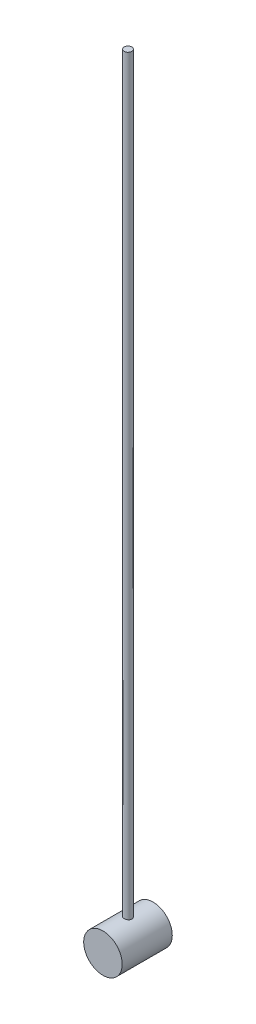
ISO-10303-21;
HEADER;
FILE_DESCRIPTION(('STEP AP214'),'2;1');
FILE_NAME('part.step','',(''),(''),'','','');
FILE_SCHEMA(('AUTOMOTIVE_DESIGN { 1 0 10303 214 1 1 1 1 }'));
ENDSEC;
DATA;
#1=APPLICATION_CONTEXT('core data for automotive mechanical design processes');
#2=APPLICATION_PROTOCOL_DEFINITION('international standard','automotive_design',2000,#1);
#3=PRODUCT_CONTEXT('',#1,'mechanical');
#4=PRODUCT('Part','Part','',(#3));
#5=PRODUCT_RELATED_PRODUCT_CATEGORY('part','',(#4));
#6=PRODUCT_DEFINITION_FORMATION('','',#4);
#7=PRODUCT_DEFINITION_CONTEXT('part definition',#1,'design');
#8=PRODUCT_DEFINITION('design','',#6,#7);
#9=PRODUCT_DEFINITION_SHAPE('','',#8);
#10=(LENGTH_UNIT() NAMED_UNIT(*) SI_UNIT(.MILLI.,.METRE.));
#11=(NAMED_UNIT(*) PLANE_ANGLE_UNIT() SI_UNIT($,.RADIAN.));
#12=(NAMED_UNIT(*) SI_UNIT($,.STERADIAN.) SOLID_ANGLE_UNIT());
#13=UNCERTAINTY_MEASURE_WITH_UNIT(LENGTH_MEASURE(1.E-05),#10,'distance_accuracy_value','');
#14=(GEOMETRIC_REPRESENTATION_CONTEXT(3) GLOBAL_UNCERTAINTY_ASSIGNED_CONTEXT((#13)) GLOBAL_UNIT_ASSIGNED_CONTEXT((#10,
#11,#12)) REPRESENTATION_CONTEXT('',''));
#15=CARTESIAN_POINT('',(0.,0.,0.));
#16=DIRECTION('',(0.,0.,1.));
#17=DIRECTION('',(1.,0.,0.));
#18=AXIS2_PLACEMENT_3D('',#15,#16,#17);
#19=CARTESIAN_POINT('',(0.,0.,3.25));
#20=DIRECTION('',(0.,0.,-1.));
#21=DIRECTION('',(-1.,0.,0.));
#22=AXIS2_PLACEMENT_3D('',#19,#20,#21);
#23=CYLINDRICAL_SURFACE('',#22,2.5);
#24=CARTESIAN_POINT('',(0.,0.,-3.25));
#25=DIRECTION('',(0.,0.,1.));
#26=DIRECTION('',(1.,0.,0.));
#27=AXIS2_PLACEMENT_3D('',#24,#25,#26);
#28=CIRCLE('',#27,2.5);
#29=CARTESIAN_POINT('',(2.5,0.,-3.25));
#30=VERTEX_POINT('',#29);
#31=EDGE_CURVE('E45',#30,#30,#28,.T.);
#32=ORIENTED_EDGE('',*,*,#31,.T.);
#33=EDGE_LOOP('',(#32));
#34=FACE_BOUND('',#33,.T.);
#35=CARTESIAN_POINT('',(0.,0.,3.25));
#36=DIRECTION('',(0.,0.,1.));
#37=DIRECTION('',(1.,0.,0.));
#38=AXIS2_PLACEMENT_3D('',#35,#36,#37);
#39=CIRCLE('',#38,2.5);
#40=CARTESIAN_POINT('',(2.5,0.,3.25));
#41=VERTEX_POINT('',#40);
#42=EDGE_CURVE('E41',#41,#41,#39,.T.);
#43=ORIENTED_EDGE('',*,*,#42,.F.);
#44=EDGE_LOOP('',(#43));
#45=FACE_BOUND('',#44,.T.);
#46=CARTESIAN_POINT('',(0.,2.49999999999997,-0.5));
#47=CARTESIAN_POINT('',(-0.027788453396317,2.49999948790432,-0.499998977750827));
#48=CARTESIAN_POINT('',(-0.055589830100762,2.49953192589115,-0.497675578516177));
#49=CARTESIAN_POINT('',(-0.110406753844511,2.49771182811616,-0.488450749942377));
#50=CARTESIAN_POINT('',(-0.137421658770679,2.49635858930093,-0.481545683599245));
#51=CARTESIAN_POINT('',(-0.189865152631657,2.49291824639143,-0.463379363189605));
#52=CARTESIAN_POINT('',(-0.215295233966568,2.49083184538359,-0.452122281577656));
#53=CARTESIAN_POINT('',(-0.263903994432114,2.48615199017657,-0.425583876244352));
#54=CARTESIAN_POINT('',(-0.287082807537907,2.48355856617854,-0.410302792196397));
#55=CARTESIAN_POINT('',(-0.330846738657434,2.47811082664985,-0.375930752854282));
#56=CARTESIAN_POINT('',(-0.351396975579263,2.47525372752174,-0.356795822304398));
#57=CARTESIAN_POINT('',(-0.389018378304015,2.46962090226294,-0.315353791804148));
#58=CARTESIAN_POINT('',(-0.406089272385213,2.46684518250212,-0.29304644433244));
#59=CARTESIAN_POINT('',(-0.436415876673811,2.46166220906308,-0.245641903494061));
#60=CARTESIAN_POINT('',(-0.449635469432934,2.45925853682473,-0.220521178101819));
#61=CARTESIAN_POINT('',(-0.471652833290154,2.45513134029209,-0.168359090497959));
#62=CARTESIAN_POINT('',(-0.480451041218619,2.45340774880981,-0.141317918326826));
#63=CARTESIAN_POINT('',(-0.493262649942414,2.45086402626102,-0.08645781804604));
#64=CARTESIAN_POINT('',(-0.497337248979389,2.45003235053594,-0.0586537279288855));
#65=CARTESIAN_POINT('',(-0.50077606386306,2.44933187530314,-0.00274508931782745));
#66=CARTESIAN_POINT('',(-0.50014076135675,2.4494629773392,0.025359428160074));
#67=CARTESIAN_POINT('',(-0.494227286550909,2.45066275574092,0.0806233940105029));
#68=CARTESIAN_POINT('',(-0.489019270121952,2.45171726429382,0.107790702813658));
#69=CARTESIAN_POINT('',(-0.474218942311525,2.45462273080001,0.160858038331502));
#70=CARTESIAN_POINT('',(-0.46462642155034,2.45647372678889,0.186758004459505));
#71=CARTESIAN_POINT('',(-0.441262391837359,2.46077809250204,0.236757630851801));
#72=CARTESIAN_POINT('',(-0.427463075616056,2.46323544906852,0.260843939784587));
#73=CARTESIAN_POINT('',(-0.396096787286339,2.46847309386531,0.306385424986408));
#74=CARTESIAN_POINT('',(-0.378529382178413,2.47125341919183,0.32784029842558));
#75=CARTESIAN_POINT('',(-0.339749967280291,2.47688510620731,0.367914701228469));
#76=CARTESIAN_POINT('',(-0.318478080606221,2.47973684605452,0.386476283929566));
#77=CARTESIAN_POINT('',(-0.273092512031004,2.48514424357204,0.419776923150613));
#78=CARTESIAN_POINT('',(-0.248978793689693,2.48769989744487,0.43451593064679));
#79=CARTESIAN_POINT('',(-0.198529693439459,2.49223345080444,0.459763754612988));
#80=CARTESIAN_POINT('',(-0.172190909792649,2.49421044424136,0.470265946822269));
#81=CARTESIAN_POINT('',(-0.118074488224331,2.49735704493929,0.486680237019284));
#82=CARTESIAN_POINT('',(-0.0902970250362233,2.49852675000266,0.492592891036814));
#83=CARTESIAN_POINT('',(-0.0345897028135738,2.49991335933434,0.499578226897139));
#84=CARTESIAN_POINT('',(-0.00667016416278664,2.50014587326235,0.500730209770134));
#85=CARTESIAN_POINT('',(0.0489624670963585,2.49967525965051,0.498375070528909));
#86=CARTESIAN_POINT('',(0.076675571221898,2.49897218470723,0.494868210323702));
#87=CARTESIAN_POINT('',(0.130852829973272,2.49671916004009,0.483360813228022));
#88=CARTESIAN_POINT('',(0.157325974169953,2.49517688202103,0.475400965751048));
#89=CARTESIAN_POINT('',(0.208561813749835,2.49141776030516,0.455258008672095));
#90=CARTESIAN_POINT('',(0.233324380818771,2.48920086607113,0.443074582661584));
#91=CARTESIAN_POINT('',(0.28077058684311,2.48429955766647,0.414658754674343));
#92=CARTESIAN_POINT('',(0.303425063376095,2.48160975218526,0.398378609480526));
#93=CARTESIAN_POINT('',(0.345709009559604,2.47607367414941,0.362295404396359));
#94=CARTESIAN_POINT('',(0.365338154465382,2.47322738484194,0.342491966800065));
#95=CARTESIAN_POINT('',(0.401320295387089,2.46764651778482,0.299563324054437));
#96=CARTESIAN_POINT('',(0.417618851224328,2.46491430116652,0.27639212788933));
#97=CARTESIAN_POINT('',(0.446092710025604,2.45992095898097,0.227594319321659));
#98=CARTESIAN_POINT('',(0.458268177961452,2.45765981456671,0.201967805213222));
#99=CARTESIAN_POINT('',(0.47807592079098,2.45388370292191,0.149115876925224));
#100=CARTESIAN_POINT('',(0.485731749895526,2.45236487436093,0.121899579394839));
#101=CARTESIAN_POINT('',(0.496354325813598,2.45023718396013,0.066533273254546));
#102=CARTESIAN_POINT('',(0.499321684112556,2.44962820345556,0.0383833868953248));
#103=CARTESIAN_POINT('',(0.500460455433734,2.4493957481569,-0.0175044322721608));
#104=CARTESIAN_POINT('',(0.498717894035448,2.4497545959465,-0.0452405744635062));
#105=CARTESIAN_POINT('',(0.49067615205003,2.45137786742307,-0.100015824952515));
#106=CARTESIAN_POINT('',(0.484377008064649,2.45264228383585,-0.127054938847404));
#107=CARTESIAN_POINT('',(0.467439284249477,2.45592632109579,-0.179613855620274));
#108=CARTESIAN_POINT('',(0.456811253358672,2.45794410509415,-0.205137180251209));
#109=CARTESIAN_POINT('',(0.431527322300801,2.46250857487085,-0.254051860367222));
#110=CARTESIAN_POINT('',(0.41687108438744,2.46505530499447,-0.27744303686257));
#111=CARTESIAN_POINT('',(0.383652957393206,2.47044480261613,-0.321857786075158));
#112=CARTESIAN_POINT('',(0.365028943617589,2.4732918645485,-0.342834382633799));
#113=CARTESIAN_POINT('',(0.324532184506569,2.47893040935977,-0.381393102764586));
#114=CARTESIAN_POINT('',(0.302658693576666,2.48172187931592,-0.398974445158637));
#115=CARTESIAN_POINT('',(0.256008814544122,2.48696916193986,-0.430417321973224));
#116=CARTESIAN_POINT('',(0.231204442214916,2.48942115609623,-0.444238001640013));
#117=CARTESIAN_POINT('',(0.179583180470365,2.493675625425,-0.467493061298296));
#118=CARTESIAN_POINT('',(0.152768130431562,2.49547868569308,-0.476931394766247));
#119=CARTESIAN_POINT('',(0.104910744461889,2.49788186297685,-0.489325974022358));
#120=CARTESIAN_POINT('',(0.0841408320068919,2.49867151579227,-0.493321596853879));
#121=CARTESIAN_POINT('',(0.0422497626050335,2.49973077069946,-0.498658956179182));
#122=CARTESIAN_POINT('',(0.0211286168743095,2.50000038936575,-0.500000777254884));
#123=CARTESIAN_POINT('',(0.,2.49999999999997,-0.5));
#124=B_SPLINE_CURVE_WITH_KNOTS('',3,(#46,#47,#48,#49,#50,#51,#52,#53,#54,#55,#56,#57,#58,#59,
#60,#61,#62,#63,#64,#65,#66,#67,#68,#69,#70,#71,#72,#73,#74,#75,#76,#77,#78,#79,#80,#81,#82,#83,
#84,#85,#86,#87,#88,#89,#90,#91,#92,#93,#94,#95,#96,#97,#98,#99,#100,#101,#102,#103,#104,#105,
#106,#107,#108,#109,#110,#111,#112,#113,#114,#115,#116,#117,#118,#119,#120,#121,#122,#123),
.UNSPECIFIED.,.T.,.F.,(4,2,2,2,2,2,2,2,2,2,2,2,2,2,2,2,2,2,2,2,2,2,2,2,2,2,2,2,2,2,2,2,2,2,2,2,
2,2,4),(0.,0.0832880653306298,0.166642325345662,0.249916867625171,0.333186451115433,
0.417466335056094,0.501752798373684,0.586805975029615,0.671850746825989,0.755780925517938,
0.839702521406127,0.922358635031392,1.00501869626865,1.08823745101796,1.17146577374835,
1.25619126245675,1.3409178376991,1.42577637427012,1.51062462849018,1.59405367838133,
1.67747803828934,1.76015226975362,1.84283269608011,1.92652533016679,2.01022694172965,
2.09520314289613,2.18017594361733,2.26470190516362,2.34921684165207,2.43219861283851,
2.51517971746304,2.59795980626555,2.68074683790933,2.76494038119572,2.84915327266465,
2.93424748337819,3.01926477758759,3.08259387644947,3.14592095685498),.UNSPECIFIED.);
#125=CARTESIAN_POINT('',(0.,2.49999999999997,-0.5));
#126=VERTEX_POINT('',#125);
#127=EDGE_CURVE('E10',#126,#126,#124,.T.);
#128=ORIENTED_EDGE('',*,*,#127,.F.);
#129=EDGE_LOOP('',(#128));
#130=FACE_BOUND('',#129,.T.);
#131=ADVANCED_FACE('F31',(#34,#45,#130),#23,.T.);
#132=CARTESIAN_POINT('',(0.,0.,3.25));
#133=DIRECTION('',(0.,0.,1.));
#134=DIRECTION('',(1.,0.,0.));
#135=AXIS2_PLACEMENT_3D('',#132,#133,#134);
#136=PLANE('',#135);
#137=ORIENTED_EDGE('',*,*,#42,.T.);
#138=EDGE_LOOP('',(#137));
#139=FACE_BOUND('',#138,.T.);
#140=ADVANCED_FACE('F65',(#139),#136,.T.);
#141=CARTESIAN_POINT('',(0.,0.,-3.25));
#142=DIRECTION('',(0.,0.,1.));
#143=DIRECTION('',(1.,0.,0.));
#144=AXIS2_PLACEMENT_3D('',#141,#142,#143);
#145=PLANE('',#144);
#146=ORIENTED_EDGE('',*,*,#31,.F.);
#147=EDGE_LOOP('',(#146));
#148=FACE_BOUND('',#147,.T.);
#149=ADVANCED_FACE('F59',(#148),#145,.F.);
#150=CARTESIAN_POINT('',(0.,100.,0.));
#151=DIRECTION('',(0.,-1.,0.));
#152=DIRECTION('',(0.,0.,-1.));
#153=AXIS2_PLACEMENT_3D('',#150,#151,#152);
#154=CYLINDRICAL_SURFACE('',#153,0.5);
#155=CARTESIAN_POINT('',(0.,100.,0.));
#156=DIRECTION('',(0.,1.,0.));
#157=DIRECTION('',(0.,0.,1.));
#158=AXIS2_PLACEMENT_3D('',#155,#156,#157);
#159=CIRCLE('',#158,0.5);
#160=CARTESIAN_POINT('',(0.,100.,0.5));
#161=VERTEX_POINT('',#160);
#162=EDGE_CURVE('E50',#161,#161,#159,.T.);
#163=ORIENTED_EDGE('',*,*,#162,.F.);
#164=EDGE_LOOP('',(#163));
#165=FACE_BOUND('',#164,.T.);
#166=ORIENTED_EDGE('',*,*,#127,.T.);
#167=EDGE_LOOP('',(#166));
#168=FACE_BOUND('',#167,.T.);
#169=ADVANCED_FACE('F57',(#165,#168),#154,.T.);
#170=CARTESIAN_POINT('',(0.,100.,0.));
#171=DIRECTION('',(0.,1.,0.));
#172=DIRECTION('',(0.,0.,1.));
#173=AXIS2_PLACEMENT_3D('',#170,#171,#172);
#174=PLANE('',#173);
#175=ORIENTED_EDGE('',*,*,#162,.T.);
#176=EDGE_LOOP('',(#175));
#177=FACE_BOUND('',#176,.T.);
#178=ADVANCED_FACE('F55',(#177),#174,.T.);
#179=CLOSED_SHELL('',(#131,#140,#149,#169,#178));
#180=MANIFOLD_SOLID_BREP('B2',#179);
#181=ADVANCED_BREP_SHAPE_REPRESENTATION('',(#18,#180),#14);
#182=SHAPE_DEFINITION_REPRESENTATION(#9,#181);
ENDSEC;
END-ISO-10303-21;
